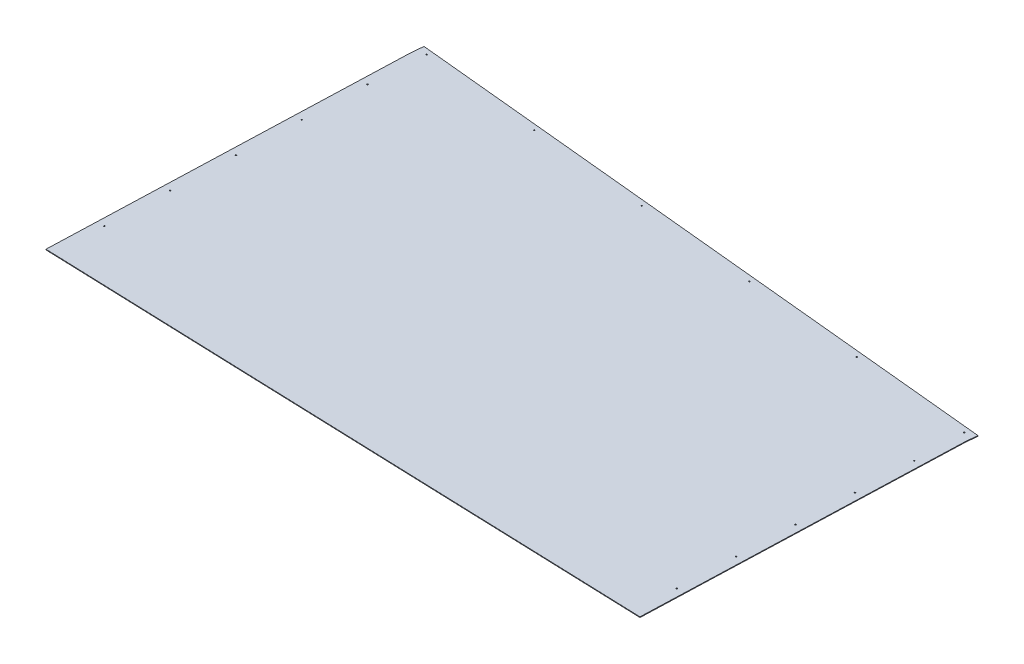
ISO-10303-21;
HEADER;
FILE_DESCRIPTION(('STEP AP214'),'2;1');
FILE_NAME('part.step','',(''),(''),'','','');
FILE_SCHEMA(('AUTOMOTIVE_DESIGN { 1 0 10303 214 1 1 1 1 }'));
ENDSEC;
DATA;
#1=APPLICATION_CONTEXT('core data for automotive mechanical design processes');
#2=APPLICATION_PROTOCOL_DEFINITION('international standard','automotive_design',2000,#1);
#3=PRODUCT_CONTEXT('',#1,'mechanical');
#4=PRODUCT('Part','Part','',(#3));
#5=PRODUCT_RELATED_PRODUCT_CATEGORY('part','',(#4));
#6=PRODUCT_DEFINITION_FORMATION('','',#4);
#7=PRODUCT_DEFINITION_CONTEXT('part definition',#1,'design');
#8=PRODUCT_DEFINITION('design','',#6,#7);
#9=PRODUCT_DEFINITION_SHAPE('','',#8);
#10=(LENGTH_UNIT() NAMED_UNIT(*) SI_UNIT(.MILLI.,.METRE.));
#11=(NAMED_UNIT(*) PLANE_ANGLE_UNIT() SI_UNIT($,.RADIAN.));
#12=(NAMED_UNIT(*) SI_UNIT($,.STERADIAN.) SOLID_ANGLE_UNIT());
#13=UNCERTAINTY_MEASURE_WITH_UNIT(LENGTH_MEASURE(1.E-05),#10,'distance_accuracy_value','');
#14=(GEOMETRIC_REPRESENTATION_CONTEXT(3) GLOBAL_UNCERTAINTY_ASSIGNED_CONTEXT((#13)) GLOBAL_UNIT_ASSIGNED_CONTEXT((#10,
#11,#12)) REPRESENTATION_CONTEXT('',''));
#15=CARTESIAN_POINT('',(0.,0.,0.));
#16=DIRECTION('',(0.,0.,1.));
#17=DIRECTION('',(1.,0.,0.));
#18=AXIS2_PLACEMENT_3D('',#15,#16,#17);
#19=CARTESIAN_POINT('',(-728.973178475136,-2.53999999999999,-1428.44640067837));
#20=DIRECTION('',(0.,1.,0.));
#21=DIRECTION('',(-0.995256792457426,0.,-0.0972826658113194));
#22=AXIS2_PLACEMENT_3D('',#19,#20,#21);
#23=CYLINDRICAL_SURFACE('',#22,1.58750000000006);
#24=CARTESIAN_POINT('',(-728.973178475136,0.,-1428.44640067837));
#25=DIRECTION('',(0.,1.,0.));
#26=DIRECTION('',(-0.995256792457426,0.,-0.0972826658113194));
#27=AXIS2_PLACEMENT_3D('',#24,#25,#26);
#28=CIRCLE('',#27,1.58750000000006);
#29=CARTESIAN_POINT('',(-730.553148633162,0.,-1428.60083691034));
#30=VERTEX_POINT('',#29);
#31=EDGE_CURVE('E198',#30,#30,#28,.T.);
#32=ORIENTED_EDGE('',*,*,#31,.T.);
#33=EDGE_LOOP('',(#32));
#34=FACE_BOUND('',#33,.T.);
#35=CARTESIAN_POINT('',(-728.973178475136,-1.62560000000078,-1428.44640067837));
#36=DIRECTION('',(0.,1.,0.));
#37=DIRECTION('',(-0.995256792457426,0.,-0.0972826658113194));
#38=AXIS2_PLACEMENT_3D('',#35,#36,#37);
#39=CIRCLE('',#38,1.58750000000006);
#40=CARTESIAN_POINT('',(-730.553148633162,-1.62560000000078,-1428.60083691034));
#41=VERTEX_POINT('',#40);
#42=EDGE_CURVE('E202',#41,#41,#39,.T.);
#43=ORIENTED_EDGE('',*,*,#42,.F.);
#44=EDGE_LOOP('',(#43));
#45=FACE_BOUND('',#44,.T.);
#46=ADVANCED_FACE('F99',(#34,#45),#23,.F.);
#47=CARTESIAN_POINT('',(-425.618908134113,-2.54000000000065,-1398.79464413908));
#48=DIRECTION('',(0.,1.,0.));
#49=DIRECTION('',(-0.995256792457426,0.,-0.0972826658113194));
#50=AXIS2_PLACEMENT_3D('',#47,#48,#49);
#51=CYLINDRICAL_SURFACE('',#50,1.58749999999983);
#52=CARTESIAN_POINT('',(-425.618908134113,-6.66133814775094E-13,-1398.79464413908));
#53=DIRECTION('',(0.,1.,0.));
#54=DIRECTION('',(-0.995256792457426,0.,-0.0972826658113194));
#55=AXIS2_PLACEMENT_3D('',#52,#53,#54);
#56=CIRCLE('',#55,1.58749999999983);
#57=CARTESIAN_POINT('',(-427.198878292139,-6.64261180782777E-13,-1398.94908037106));
#58=VERTEX_POINT('',#57);
#59=EDGE_CURVE('E241',#58,#58,#56,.T.);
#60=ORIENTED_EDGE('',*,*,#59,.T.);
#61=EDGE_LOOP('',(#60));
#62=FACE_BOUND('',#61,.T.);
#63=CARTESIAN_POINT('',(-425.618908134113,-1.62560000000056,-1398.79464413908));
#64=DIRECTION('',(0.,1.,0.));
#65=DIRECTION('',(-0.995256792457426,0.,-0.0972826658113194));
#66=AXIS2_PLACEMENT_3D('',#63,#64,#65);
#67=CIRCLE('',#66,1.58749999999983);
#68=CARTESIAN_POINT('',(-427.198878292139,-1.62560000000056,-1398.94908037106));
#69=VERTEX_POINT('',#68);
#70=EDGE_CURVE('E205',#69,#69,#67,.T.);
#71=ORIENTED_EDGE('',*,*,#70,.F.);
#72=EDGE_LOOP('',(#71));
#73=FACE_BOUND('',#72,.T.);
#74=ADVANCED_FACE('F273',(#62,#73),#51,.F.);
#75=CARTESIAN_POINT('',(-122.264637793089,-2.54000000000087,-1369.14288759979));
#76=DIRECTION('',(0.,1.,0.));
#77=DIRECTION('',(-0.995256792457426,0.,-0.0972826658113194));
#78=AXIS2_PLACEMENT_3D('',#75,#76,#77);
#79=CYLINDRICAL_SURFACE('',#78,1.58750000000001);
#80=CARTESIAN_POINT('',(-122.264637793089,-8.88178419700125E-13,-1369.14288759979));
#81=DIRECTION('',(0.,1.,0.));
#82=DIRECTION('',(-0.995256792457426,0.,-0.0972826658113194));
#83=AXIS2_PLACEMENT_3D('',#80,#81,#82);
#84=CIRCLE('',#83,1.58750000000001);
#85=CARTESIAN_POINT('',(-123.844607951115,-8.86305785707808E-13,-1369.29732383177));
#86=VERTEX_POINT('',#85);
#87=EDGE_CURVE('E238',#86,#86,#84,.T.);
#88=ORIENTED_EDGE('',*,*,#87,.T.);
#89=EDGE_LOOP('',(#88));
#90=FACE_BOUND('',#89,.T.);
#91=CARTESIAN_POINT('',(-122.264637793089,-1.62560000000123,-1369.14288759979));
#92=DIRECTION('',(0.,1.,0.));
#93=DIRECTION('',(-0.995256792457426,0.,-0.0972826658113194));
#94=AXIS2_PLACEMENT_3D('',#91,#92,#93);
#95=CIRCLE('',#94,1.58750000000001);
#96=CARTESIAN_POINT('',(-123.844607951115,-1.62560000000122,-1369.29732383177));
#97=VERTEX_POINT('',#96);
#98=EDGE_CURVE('E208',#97,#97,#95,.T.);
#99=ORIENTED_EDGE('',*,*,#98,.F.);
#100=EDGE_LOOP('',(#99));
#101=FACE_BOUND('',#100,.T.);
#102=ADVANCED_FACE('F279',(#90,#101),#79,.F.);
#103=CARTESIAN_POINT('',(181.089632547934,-2.54000000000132,-1339.4911310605));
#104=DIRECTION('',(0.,1.,0.));
#105=DIRECTION('',(-0.995256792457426,0.,-0.0972826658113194));
#106=AXIS2_PLACEMENT_3D('',#103,#104,#105);
#107=CYLINDRICAL_SURFACE('',#106,1.58750000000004);
#108=CARTESIAN_POINT('',(181.089632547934,-1.33226762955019E-12,-1339.4911310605));
#109=DIRECTION('',(0.,1.,0.));
#110=DIRECTION('',(-0.995256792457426,0.,-0.0972826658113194));
#111=AXIS2_PLACEMENT_3D('',#108,#109,#110);
#112=CIRCLE('',#111,1.58750000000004);
#113=CARTESIAN_POINT('',(179.509662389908,-1.33039499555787E-12,-1339.64556729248));
#114=VERTEX_POINT('',#113);
#115=EDGE_CURVE('E235',#114,#114,#112,.T.);
#116=ORIENTED_EDGE('',*,*,#115,.T.);
#117=EDGE_LOOP('',(#116));
#118=FACE_BOUND('',#117,.T.);
#119=CARTESIAN_POINT('',(181.089632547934,-1.62560000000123,-1339.4911310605));
#120=DIRECTION('',(0.,1.,0.));
#121=DIRECTION('',(-0.995256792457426,0.,-0.0972826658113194));
#122=AXIS2_PLACEMENT_3D('',#119,#120,#121);
#123=CIRCLE('',#122,1.58750000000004);
#124=CARTESIAN_POINT('',(179.509662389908,-1.62560000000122,-1339.64556729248));
#125=VERTEX_POINT('',#124);
#126=EDGE_CURVE('E211',#125,#125,#123,.T.);
#127=ORIENTED_EDGE('',*,*,#126,.F.);
#128=EDGE_LOOP('',(#127));
#129=FACE_BOUND('',#128,.T.);
#130=ADVANCED_FACE('F288',(#118,#129),#107,.F.);
#131=CARTESIAN_POINT('',(484.443902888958,-2.54000000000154,-1309.83937452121));
#132=DIRECTION('',(0.,1.,0.));
#133=DIRECTION('',(-0.995256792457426,0.,-0.0972826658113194));
#134=AXIS2_PLACEMENT_3D('',#131,#132,#133);
#135=CYLINDRICAL_SURFACE('',#134,1.58750000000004);
#136=CARTESIAN_POINT('',(484.443902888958,-1.77635683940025E-12,-1309.83937452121));
#137=DIRECTION('',(0.,1.,0.));
#138=DIRECTION('',(-0.995256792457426,0.,-0.0972826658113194));
#139=AXIS2_PLACEMENT_3D('',#136,#137,#138);
#140=CIRCLE('',#139,1.58750000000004);
#141=CARTESIAN_POINT('',(482.863932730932,-1.77448420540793E-12,-1309.99381075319));
#142=VERTEX_POINT('',#141);
#143=EDGE_CURVE('E232',#142,#142,#140,.T.);
#144=ORIENTED_EDGE('',*,*,#143,.T.);
#145=EDGE_LOOP('',(#144));
#146=FACE_BOUND('',#145,.T.);
#147=CARTESIAN_POINT('',(484.443902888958,-1.62560000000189,-1309.83937452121));
#148=DIRECTION('',(0.,1.,0.));
#149=DIRECTION('',(-0.995256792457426,0.,-0.0972826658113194));
#150=AXIS2_PLACEMENT_3D('',#147,#148,#149);
#151=CIRCLE('',#150,1.58750000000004);
#152=CARTESIAN_POINT('',(482.863932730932,-1.62560000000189,-1309.99381075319));
#153=VERTEX_POINT('',#152);
#154=EDGE_CURVE('E214',#153,#153,#151,.T.);
#155=ORIENTED_EDGE('',*,*,#154,.F.);
#156=EDGE_LOOP('',(#155));
#157=FACE_BOUND('',#156,.T.);
#158=ADVANCED_FACE('F292',(#146,#157),#135,.F.);
#159=CARTESIAN_POINT('',(787.798173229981,-2.54000000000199,-1280.18761798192));
#160=DIRECTION('',(0.,1.,0.));
#161=DIRECTION('',(-0.995256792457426,0.,-0.0972826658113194));
#162=AXIS2_PLACEMENT_3D('',#159,#160,#161);
#163=CYLINDRICAL_SURFACE('',#162,1.58749999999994);
#164=CARTESIAN_POINT('',(787.798173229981,-1.99840144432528E-12,-1280.18761798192));
#165=DIRECTION('',(0.,1.,0.));
#166=DIRECTION('',(-0.995256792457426,0.,-0.0972826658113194));
#167=AXIS2_PLACEMENT_3D('',#164,#165,#166);
#168=CIRCLE('',#167,1.58749999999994);
#169=CARTESIAN_POINT('',(786.218203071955,-1.99652881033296E-12,-1280.3420542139));
#170=VERTEX_POINT('',#169);
#171=EDGE_CURVE('E229',#170,#170,#168,.T.);
#172=ORIENTED_EDGE('',*,*,#171,.T.);
#173=EDGE_LOOP('',(#172));
#174=FACE_BOUND('',#173,.T.);
#175=CARTESIAN_POINT('',(787.798173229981,-1.62560000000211,-1280.18761798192));
#176=DIRECTION('',(0.,1.,0.));
#177=DIRECTION('',(-0.995256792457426,0.,-0.0972826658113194));
#178=AXIS2_PLACEMENT_3D('',#175,#176,#177);
#179=CIRCLE('',#178,1.58749999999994);
#180=CARTESIAN_POINT('',(786.218203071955,-1.62560000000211,-1280.3420542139));
#181=VERTEX_POINT('',#180);
#182=EDGE_CURVE('E217',#181,#181,#179,.T.);
#183=ORIENTED_EDGE('',*,*,#182,.F.);
#184=EDGE_LOOP('',(#183));
#185=FACE_BOUND('',#184,.T.);
#186=ADVANCED_FACE('F270',(#174,#185),#163,.F.);
#187=CARTESIAN_POINT('',(2192.56312068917,-3152.84793886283,-1155.63757233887));
#188=DIRECTION('',(0.0972826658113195,0.,-0.995256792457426));
#189=DIRECTION('',(-0.995256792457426,0.,-0.0972826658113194));
#190=AXIS2_PLACEMENT_3D('',#187,#188,#189);
#191=PLANE('',#190);
#192=DIRECTION('',(0.,1.,0.));
#193=VECTOR('',#192,1.);
#194=CARTESIAN_POINT('',(-750.455172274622,-3152.84793886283,-1443.30671184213));
#195=LINE('',#194,#193);
#196=CARTESIAN_POINT('',(-750.455172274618,-1.62559999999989,-1443.30671184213));
#197=VERTEX_POINT('',#196);
#198=CARTESIAN_POINT('',(-750.455172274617,0.,-1443.30671184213));
#199=VERTEX_POINT('',#198);
#200=EDGE_CURVE('E227',#197,#199,#195,.T.);
#201=ORIENTED_EDGE('',*,*,#200,.T.);
#202=DIRECTION('',(0.995256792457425,0.,0.0972826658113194));
#203=VECTOR('',#202,1.);
#204=CARTESIAN_POINT('',(2192.56312068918,-3.5527136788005E-12,-1155.63757233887));
#205=LINE('',#204,#203);
#206=CARTESIAN_POINT('',(811.943230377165,-1.77635683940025E-12,-1290.58805388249));
#207=VERTEX_POINT('',#206);
#208=EDGE_CURVE('E225',#199,#207,#205,.T.);
#209=ORIENTED_EDGE('',*,*,#208,.T.);
#210=DIRECTION('',(0.,1.,0.));
#211=VECTOR('',#210,1.);
#212=CARTESIAN_POINT('',(811.943230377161,-3152.84793886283,-1290.58805388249));
#213=LINE('',#212,#211);
#214=CARTESIAN_POINT('',(811.943230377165,-1.62560000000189,-1290.58805388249));
#215=VERTEX_POINT('',#214);
#216=EDGE_CURVE('E221',#215,#207,#213,.T.);
#217=ORIENTED_EDGE('',*,*,#216,.F.);
#218=DIRECTION('',(-0.995256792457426,0.,-0.0972826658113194));
#219=VECTOR('',#218,1.);
#220=CARTESIAN_POINT('',(2192.56312068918,-1.62560000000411,-1155.63757233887));
#221=LINE('',#220,#219);
#222=EDGE_CURVE('E136',#215,#197,#221,.T.);
#223=ORIENTED_EDGE('',*,*,#222,.T.);
#224=EDGE_LOOP('',(#201,#209,#217,#223));
#225=FACE_BOUND('',#224,.T.);
#226=ADVANCED_FACE('F260',(#225),#191,.T.);
#227=CARTESIAN_POINT('',(-753.543896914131,-3152.84793886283,-1411.7073086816));
#228=DIRECTION('',(0.995256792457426,0.,0.0972826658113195));
#229=DIRECTION('',(0.0972826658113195,0.,-0.995256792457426));
#230=AXIS2_PLACEMENT_3D('',#227,#228,#229);
#231=PLANE('',#230);
#232=DIRECTION('',(-0.0972826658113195,0.,0.995256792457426));
#233=VECTOR('',#232,1.);
#234=CARTESIAN_POINT('',(-753.543896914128,0.,-1411.7073086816));
#235=LINE('',#234,#233);
#236=CARTESIAN_POINT('',(-753.44208377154,-1.16226472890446E-13,-1412.7489148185));
#237=VERTEX_POINT('',#236);
#238=EDGE_CURVE('E150',#199,#237,#235,.T.);
#239=ORIENTED_EDGE('',*,*,#238,.F.);
#240=ORIENTED_EDGE('',*,*,#200,.F.);
#241=DIRECTION('',(0.0972826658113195,0.,-0.995256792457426));
#242=VECTOR('',#241,1.);
#243=CARTESIAN_POINT('',(-753.543896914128,-1.62560000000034,-1411.7073086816));
#244=LINE('',#243,#242);
#245=CARTESIAN_POINT('',(-753.44208377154,-1.62560000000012,-1412.7489148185));
#246=VERTEX_POINT('',#245);
#247=EDGE_CURVE('E13',#246,#197,#244,.T.);
#248=ORIENTED_EDGE('',*,*,#247,.F.);
#249=DIRECTION('',(0.,-1.,0.));
#250=VECTOR('',#249,1.);
#251=CARTESIAN_POINT('',(-753.44208377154,-0.812800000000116,-1412.7489148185));
#252=LINE('',#251,#250);
#253=EDGE_CURVE('E174',#237,#246,#252,.T.);
#254=ORIENTED_EDGE('',*,*,#253,.F.);
#255=EDGE_LOOP('',(#239,#240,#248,#254));
#256=FACE_BOUND('',#255,.T.);
#257=ADVANCED_FACE('F262',(#256),#231,.F.);
#258=CARTESIAN_POINT('',(129.551766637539,-1.55431223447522E-12,-1325.38797786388));
#259=DIRECTION('',(0.,1.,0.));
#260=DIRECTION('',(-0.995256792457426,0.,-0.0972826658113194));
#261=AXIS2_PLACEMENT_3D('',#258,#259,#260);
#262=PLANE('',#261);
#263=ORIENTED_EDGE('',*,*,#238,.T.);
#264=DIRECTION('',(0.034738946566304,0.,-0.999396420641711));
#265=VECTOR('',#264,1.);
#266=CARTESIAN_POINT('',(-753.498666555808,-1.1666015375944E-13,-1411.12109827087));
#267=LINE('',#266,#265);
#268=CARTESIAN_POINT('',(-784.630637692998,0.,-515.492888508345));
#269=VERTEX_POINT('',#268);
#270=EDGE_CURVE('E184',#269,#237,#267,.T.);
#271=ORIENTED_EDGE('',*,*,#270,.F.);
#272=DIRECTION('',(0.999396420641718,0.,0.0347389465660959));
#273=VECTOR('',#272,1.);
#274=CARTESIAN_POINT('',(2571.71966629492,0.,-398.82639715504));
#275=LINE('',#274,#273);
#276=CARTESIAN_POINT('',(781.286136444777,0.,-461.06173584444));
#277=VERTEX_POINT('',#276);
#278=EDGE_CURVE('E183',#269,#277,#275,.T.);
#279=ORIENTED_EDGE('',*,*,#278,.T.);
#280=DIRECTION('',(-0.0347389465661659,0.,0.999396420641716));
#281=VECTOR('',#280,1.);
#282=CARTESIAN_POINT('',(809.114461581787,-1.08853898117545E-13,-1261.64814630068));
#283=LINE('',#282,#281);
#284=CARTESIAN_POINT('',(809.114461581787,-1.0842021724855E-13,-1261.64814630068));
#285=VERTEX_POINT('',#284);
#286=EDGE_CURVE('E158',#285,#277,#283,.T.);
#287=ORIENTED_EDGE('',*,*,#286,.F.);
#288=DIRECTION('',(-0.0972826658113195,0.,0.995256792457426));
#289=VECTOR('',#288,1.);
#290=CARTESIAN_POINT('',(808.854505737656,-1.77635683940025E-12,-1258.98865072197));
#291=LINE('',#290,#289);
#292=EDGE_CURVE('E129',#207,#285,#291,.T.);
#293=ORIENTED_EDGE('',*,*,#292,.F.);
#294=ORIENTED_EDGE('',*,*,#208,.F.);
#295=EDGE_LOOP('',(#263,#271,#279,#287,#293,#294));
#296=FACE_BOUND('',#295,.T.);
#297=ORIENTED_EDGE('',*,*,#171,.F.);
#298=EDGE_LOOP('',(#297));
#299=FACE_BOUND('',#298,.T.);
#300=ORIENTED_EDGE('',*,*,#143,.F.);
#301=EDGE_LOOP('',(#300));
#302=FACE_BOUND('',#301,.T.);
#303=ORIENTED_EDGE('',*,*,#115,.F.);
#304=EDGE_LOOP('',(#303));
#305=FACE_BOUND('',#304,.T.);
#306=ORIENTED_EDGE('',*,*,#87,.F.);
#307=EDGE_LOOP('',(#306));
#308=FACE_BOUND('',#307,.T.);
#309=ORIENTED_EDGE('',*,*,#59,.F.);
#310=EDGE_LOOP('',(#309));
#311=FACE_BOUND('',#310,.T.);
#312=ORIENTED_EDGE('',*,*,#31,.F.);
#313=EDGE_LOOP('',(#312));
#314=FACE_BOUND('',#313,.T.);
#315=CARTESIAN_POINT('',(-761.21977537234,0.,-640.618502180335));
#316=DIRECTION('',(0.,1.,0.));
#317=DIRECTION('',(-1.,0.,0.));
#318=AXIS2_PLACEMENT_3D('',#315,#316,#317);
#319=CIRCLE('',#318,1.58750000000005);
#320=CARTESIAN_POINT('',(-762.80727537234,0.,-640.618502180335));
#321=VERTEX_POINT('',#320);
#322=EDGE_CURVE('E623',#321,#321,#319,.F.);
#323=ORIENTED_EDGE('',*,*,#322,.T.);
#324=EDGE_LOOP('',(#323));
#325=FACE_BOUND('',#324,.T.);
#326=CARTESIAN_POINT('',(-755.594671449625,0.,-802.445767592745));
#327=DIRECTION('',(0.,1.,0.));
#328=DIRECTION('',(-1.,0.,0.));
#329=AXIS2_PLACEMENT_3D('',#326,#327,#328);
#330=CIRCLE('',#329,1.58750000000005);
#331=CARTESIAN_POINT('',(-757.182171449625,0.,-802.445767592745));
#332=VERTEX_POINT('',#331);
#333=EDGE_CURVE('E620',#332,#332,#330,.F.);
#334=ORIENTED_EDGE('',*,*,#333,.T.);
#335=EDGE_LOOP('',(#334));
#336=FACE_BOUND('',#335,.T.);
#337=CARTESIAN_POINT('',(-749.969567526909,0.,-964.273033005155));
#338=DIRECTION('',(0.,1.,0.));
#339=DIRECTION('',(-1.,0.,0.));
#340=AXIS2_PLACEMENT_3D('',#337,#338,#339);
#341=CIRCLE('',#340,1.58750000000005);
#342=CARTESIAN_POINT('',(-751.55706752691,0.,-964.273033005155));
#343=VERTEX_POINT('',#342);
#344=EDGE_CURVE('E617',#343,#343,#341,.F.);
#345=ORIENTED_EDGE('',*,*,#344,.T.);
#346=EDGE_LOOP('',(#345));
#347=FACE_BOUND('',#346,.T.);
#348=CARTESIAN_POINT('',(-744.344463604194,0.,-1126.10029841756));
#349=DIRECTION('',(0.,1.,0.));
#350=DIRECTION('',(-1.,0.,0.));
#351=AXIS2_PLACEMENT_3D('',#348,#349,#350);
#352=CIRCLE('',#351,1.58749999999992);
#353=CARTESIAN_POINT('',(-745.931963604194,0.,-1126.10029841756));
#354=VERTEX_POINT('',#353);
#355=EDGE_CURVE('E614',#354,#354,#352,.F.);
#356=ORIENTED_EDGE('',*,*,#355,.T.);
#357=EDGE_LOOP('',(#356));
#358=FACE_BOUND('',#357,.T.);
#359=CARTESIAN_POINT('',(-738.719359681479,0.,-1287.92756382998));
#360=DIRECTION('',(0.,1.,0.));
#361=DIRECTION('',(-1.,0.,0.));
#362=AXIS2_PLACEMENT_3D('',#359,#360,#361);
#363=CIRCLE('',#362,1.58750000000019);
#364=CARTESIAN_POINT('',(-740.306859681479,0.,-1287.92756382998));
#365=VERTEX_POINT('',#364);
#366=EDGE_CURVE('E611',#365,#365,#363,.F.);
#367=ORIENTED_EDGE('',*,*,#366,.T.);
#368=EDGE_LOOP('',(#367));
#369=FACE_BOUND('',#368,.T.);
#370=CARTESIAN_POINT('',(786.309043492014,0.,-1153.94041247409));
#371=DIRECTION('',(0.,1.,0.));
#372=DIRECTION('',(-1.,0.,0.));
#373=AXIS2_PLACEMENT_3D('',#370,#371,#372);
#374=CIRCLE('',#373,1.58749999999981);
#375=CARTESIAN_POINT('',(784.721543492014,0.,-1153.94041247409));
#376=VERTEX_POINT('',#375);
#377=EDGE_CURVE('E608',#376,#376,#374,.F.);
#378=ORIENTED_EDGE('',*,*,#377,.T.);
#379=EDGE_LOOP('',(#378));
#380=FACE_BOUND('',#379,.T.);
#381=CARTESIAN_POINT('',(781.235420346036,0.,-1007.97856523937));
#382=DIRECTION('',(0.,1.,0.));
#383=DIRECTION('',(-1.,0.,0.));
#384=AXIS2_PLACEMENT_3D('',#381,#382,#383);
#385=CIRCLE('',#384,1.58749999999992);
#386=CARTESIAN_POINT('',(779.647920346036,0.,-1007.97856523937));
#387=VERTEX_POINT('',#386);
#388=EDGE_CURVE('E605',#387,#387,#385,.F.);
#389=ORIENTED_EDGE('',*,*,#388,.T.);
#390=EDGE_LOOP('',(#389));
#391=FACE_BOUND('',#390,.T.);
#392=CARTESIAN_POINT('',(776.161797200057,0.,-862.016718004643));
#393=DIRECTION('',(0.,1.,0.));
#394=DIRECTION('',(-1.,0.,0.));
#395=AXIS2_PLACEMENT_3D('',#392,#393,#394);
#396=CIRCLE('',#395,1.58749999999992);
#397=CARTESIAN_POINT('',(774.574297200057,0.,-862.016718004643));
#398=VERTEX_POINT('',#397);
#399=EDGE_CURVE('E600',#398,#398,#396,.F.);
#400=ORIENTED_EDGE('',*,*,#399,.T.);
#401=EDGE_LOOP('',(#400));
#402=FACE_BOUND('',#401,.T.);
#403=CARTESIAN_POINT('',(771.088174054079,0.,-716.054870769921));
#404=DIRECTION('',(0.,1.,0.));
#405=DIRECTION('',(-1.,0.,0.));
#406=AXIS2_PLACEMENT_3D('',#403,#404,#405);
#407=CIRCLE('',#406,1.58749999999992);
#408=CARTESIAN_POINT('',(769.500674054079,0.,-716.054870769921));
#409=VERTEX_POINT('',#408);
#410=EDGE_CURVE('E597',#409,#409,#407,.F.);
#411=ORIENTED_EDGE('',*,*,#410,.T.);
#412=EDGE_LOOP('',(#411));
#413=FACE_BOUND('',#412,.T.);
#414=CARTESIAN_POINT('',(766.0145509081,0.,-570.093023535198));
#415=DIRECTION('',(0.,1.,0.));
#416=DIRECTION('',(-1.,0.,0.));
#417=AXIS2_PLACEMENT_3D('',#414,#415,#416);
#418=CIRCLE('',#417,1.5874999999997);
#419=CARTESIAN_POINT('',(764.4270509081,0.,-570.093023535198));
#420=VERTEX_POINT('',#419);
#421=EDGE_CURVE('E256',#420,#420,#418,.F.);
#422=ORIENTED_EDGE('',*,*,#421,.T.);
#423=EDGE_LOOP('',(#422));
#424=FACE_BOUND('',#423,.T.);
#425=ADVANCED_FACE('F254',(#296,#299,#302,#305,#308,#311,#314,#325,#336,#347,#358,#369,#380,
#391,#402,#413,#424),#262,.T.);
#426=CARTESIAN_POINT('',(808.854505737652,-3152.84793886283,-1258.98865072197));
#427=DIRECTION('',(0.995256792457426,0.,0.0972826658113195));
#428=DIRECTION('',(0.0972826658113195,0.,-0.995256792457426));
#429=AXIS2_PLACEMENT_3D('',#426,#427,#428);
#430=PLANE('',#429);
#431=ORIENTED_EDGE('',*,*,#216,.T.);
#432=ORIENTED_EDGE('',*,*,#292,.T.);
#433=DIRECTION('',(0.,-1.,0.));
#434=VECTOR('',#433,1.);
#435=CARTESIAN_POINT('',(809.114461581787,-0.812800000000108,-1261.64814630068));
#436=LINE('',#435,#434);
#437=CARTESIAN_POINT('',(809.114461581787,-1.62560000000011,-1261.64814630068));
#438=VERTEX_POINT('',#437);
#439=EDGE_CURVE('E199',#285,#438,#436,.T.);
#440=ORIENTED_EDGE('',*,*,#439,.T.);
#441=DIRECTION('',(-0.0972826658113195,0.,0.995256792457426));
#442=VECTOR('',#441,1.);
#443=CARTESIAN_POINT('',(808.854505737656,-1.62560000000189,-1258.98865072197));
#444=LINE('',#443,#442);
#445=EDGE_CURVE('E109',#215,#438,#444,.T.);
#446=ORIENTED_EDGE('',*,*,#445,.F.);
#447=EDGE_LOOP('',(#431,#432,#440,#446));
#448=FACE_BOUND('',#447,.T.);
#449=ADVANCED_FACE('F259',(#448),#430,.T.);
#450=CARTESIAN_POINT('',(0.,-1.6256,0.));
#451=DIRECTION('',(0.,1.,0.));
#452=DIRECTION('',(-1.,0.,0.));
#453=AXIS2_PLACEMENT_3D('',#450,#451,#452);
#454=PLANE('',#453);
#455=ORIENTED_EDGE('',*,*,#182,.T.);
#456=EDGE_LOOP('',(#455));
#457=FACE_BOUND('',#456,.T.);
#458=ORIENTED_EDGE('',*,*,#154,.T.);
#459=EDGE_LOOP('',(#458));
#460=FACE_BOUND('',#459,.T.);
#461=ORIENTED_EDGE('',*,*,#126,.T.);
#462=EDGE_LOOP('',(#461));
#463=FACE_BOUND('',#462,.T.);
#464=ORIENTED_EDGE('',*,*,#98,.T.);
#465=EDGE_LOOP('',(#464));
#466=FACE_BOUND('',#465,.T.);
#467=ORIENTED_EDGE('',*,*,#70,.T.);
#468=EDGE_LOOP('',(#467));
#469=FACE_BOUND('',#468,.T.);
#470=ORIENTED_EDGE('',*,*,#42,.T.);
#471=EDGE_LOOP('',(#470));
#472=FACE_BOUND('',#471,.T.);
#473=ORIENTED_EDGE('',*,*,#445,.T.);
#474=DIRECTION('',(-0.0347389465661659,0.,0.999396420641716));
#475=VECTOR('',#474,1.);
#476=CARTESIAN_POINT('',(809.114461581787,-1.62560000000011,-1261.64814630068));
#477=LINE('',#476,#475);
#478=CARTESIAN_POINT('',(781.286136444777,-1.62560000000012,-461.061735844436));
#479=VERTEX_POINT('',#478);
#480=EDGE_CURVE('E176',#438,#479,#477,.T.);
#481=ORIENTED_EDGE('',*,*,#480,.T.);
#482=DIRECTION('',(0.999396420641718,0.,0.0347389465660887));
#483=VECTOR('',#482,1.);
#484=CARTESIAN_POINT('',(-2552.7,-1.62560000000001,-576.950850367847));
#485=LINE('',#484,#483);
#486=CARTESIAN_POINT('',(-784.630637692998,-1.6256,-515.492888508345));
#487=VERTEX_POINT('',#486);
#488=EDGE_CURVE('E182',#487,#479,#485,.T.);
#489=ORIENTED_EDGE('',*,*,#488,.F.);
#490=DIRECTION('',(0.034738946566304,0.,-0.999396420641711));
#491=VECTOR('',#490,1.);
#492=CARTESIAN_POINT('',(-753.498666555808,-1.62560000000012,-1411.12109827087));
#493=LINE('',#492,#491);
#494=EDGE_CURVE('E169',#487,#246,#493,.T.);
#495=ORIENTED_EDGE('',*,*,#494,.T.);
#496=ORIENTED_EDGE('',*,*,#247,.T.);
#497=ORIENTED_EDGE('',*,*,#222,.F.);
#498=EDGE_LOOP('',(#473,#481,#489,#495,#496,#497));
#499=FACE_BOUND('',#498,.T.);
#500=CARTESIAN_POINT('',(766.0145509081,-1.6256,-570.093023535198));
#501=DIRECTION('',(0.,-1.,0.));
#502=DIRECTION('',(1.,0.,0.));
#503=AXIS2_PLACEMENT_3D('',#500,#501,#502);
#504=CIRCLE('',#503,1.5874999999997);
#505=CARTESIAN_POINT('',(767.6020509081,-1.6256,-570.093023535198));
#506=VERTEX_POINT('',#505);
#507=EDGE_CURVE('E593',#506,#506,#504,.T.);
#508=ORIENTED_EDGE('',*,*,#507,.F.);
#509=EDGE_LOOP('',(#508));
#510=FACE_BOUND('',#509,.T.);
#511=CARTESIAN_POINT('',(771.088174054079,-1.6256,-716.054870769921));
#512=DIRECTION('',(0.,-1.,0.));
#513=DIRECTION('',(1.,0.,0.));
#514=AXIS2_PLACEMENT_3D('',#511,#512,#513);
#515=CIRCLE('',#514,1.58749999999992);
#516=CARTESIAN_POINT('',(772.675674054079,-1.6256,-716.054870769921));
#517=VERTEX_POINT('',#516);
#518=EDGE_CURVE('E627',#517,#517,#515,.T.);
#519=ORIENTED_EDGE('',*,*,#518,.F.);
#520=EDGE_LOOP('',(#519));
#521=FACE_BOUND('',#520,.T.);
#522=CARTESIAN_POINT('',(776.161797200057,-1.6256,-862.016718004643));
#523=DIRECTION('',(0.,-1.,0.));
#524=DIRECTION('',(1.,0.,0.));
#525=AXIS2_PLACEMENT_3D('',#522,#523,#524);
#526=CIRCLE('',#525,1.58749999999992);
#527=CARTESIAN_POINT('',(777.749297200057,-1.6256,-862.016718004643));
#528=VERTEX_POINT('',#527);
#529=EDGE_CURVE('E630',#528,#528,#526,.T.);
#530=ORIENTED_EDGE('',*,*,#529,.F.);
#531=EDGE_LOOP('',(#530));
#532=FACE_BOUND('',#531,.T.);
#533=CARTESIAN_POINT('',(781.235420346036,-1.6256,-1007.97856523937));
#534=DIRECTION('',(0.,-1.,0.));
#535=DIRECTION('',(1.,0.,0.));
#536=AXIS2_PLACEMENT_3D('',#533,#534,#535);
#537=CIRCLE('',#536,1.58749999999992);
#538=CARTESIAN_POINT('',(782.822920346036,-1.6256,-1007.97856523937));
#539=VERTEX_POINT('',#538);
#540=EDGE_CURVE('E633',#539,#539,#537,.T.);
#541=ORIENTED_EDGE('',*,*,#540,.F.);
#542=EDGE_LOOP('',(#541));
#543=FACE_BOUND('',#542,.T.);
#544=CARTESIAN_POINT('',(786.309043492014,-1.6256,-1153.94041247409));
#545=DIRECTION('',(0.,-1.,0.));
#546=DIRECTION('',(1.,0.,0.));
#547=AXIS2_PLACEMENT_3D('',#544,#545,#546);
#548=CIRCLE('',#547,1.58749999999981);
#549=CARTESIAN_POINT('',(787.896543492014,-1.6256,-1153.94041247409));
#550=VERTEX_POINT('',#549);
#551=EDGE_CURVE('E636',#550,#550,#548,.T.);
#552=ORIENTED_EDGE('',*,*,#551,.F.);
#553=EDGE_LOOP('',(#552));
#554=FACE_BOUND('',#553,.T.);
#555=CARTESIAN_POINT('',(-738.719359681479,-1.6256,-1287.92756382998));
#556=DIRECTION('',(0.,-1.,0.));
#557=DIRECTION('',(1.,0.,0.));
#558=AXIS2_PLACEMENT_3D('',#555,#556,#557);
#559=CIRCLE('',#558,1.58750000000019);
#560=CARTESIAN_POINT('',(-737.131859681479,-1.6256,-1287.92756382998));
#561=VERTEX_POINT('',#560);
#562=EDGE_CURVE('E639',#561,#561,#559,.T.);
#563=ORIENTED_EDGE('',*,*,#562,.F.);
#564=EDGE_LOOP('',(#563));
#565=FACE_BOUND('',#564,.T.);
#566=CARTESIAN_POINT('',(-744.344463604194,-1.6256,-1126.10029841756));
#567=DIRECTION('',(0.,-1.,0.));
#568=DIRECTION('',(1.,0.,0.));
#569=AXIS2_PLACEMENT_3D('',#566,#567,#568);
#570=CIRCLE('',#569,1.58749999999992);
#571=CARTESIAN_POINT('',(-742.756963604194,-1.6256,-1126.10029841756));
#572=VERTEX_POINT('',#571);
#573=EDGE_CURVE('E642',#572,#572,#570,.T.);
#574=ORIENTED_EDGE('',*,*,#573,.F.);
#575=EDGE_LOOP('',(#574));
#576=FACE_BOUND('',#575,.T.);
#577=CARTESIAN_POINT('',(-749.969567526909,-1.6256,-964.273033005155));
#578=DIRECTION('',(0.,-1.,0.));
#579=DIRECTION('',(1.,0.,0.));
#580=AXIS2_PLACEMENT_3D('',#577,#578,#579);
#581=CIRCLE('',#580,1.58750000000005);
#582=CARTESIAN_POINT('',(-748.382067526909,-1.6256,-964.273033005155));
#583=VERTEX_POINT('',#582);
#584=EDGE_CURVE('E645',#583,#583,#581,.T.);
#585=ORIENTED_EDGE('',*,*,#584,.F.);
#586=EDGE_LOOP('',(#585));
#587=FACE_BOUND('',#586,.T.);
#588=CARTESIAN_POINT('',(-755.594671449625,-1.6256,-802.445767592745));
#589=DIRECTION('',(0.,-1.,0.));
#590=DIRECTION('',(1.,0.,0.));
#591=AXIS2_PLACEMENT_3D('',#588,#589,#590);
#592=CIRCLE('',#591,1.58750000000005);
#593=CARTESIAN_POINT('',(-754.007171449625,-1.6256,-802.445767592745));
#594=VERTEX_POINT('',#593);
#595=EDGE_CURVE('E192',#594,#594,#592,.T.);
#596=ORIENTED_EDGE('',*,*,#595,.F.);
#597=EDGE_LOOP('',(#596));
#598=FACE_BOUND('',#597,.T.);
#599=CARTESIAN_POINT('',(-761.21977537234,-1.6256,-640.618502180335));
#600=DIRECTION('',(0.,-1.,0.));
#601=DIRECTION('',(1.,0.,0.));
#602=AXIS2_PLACEMENT_3D('',#599,#600,#601);
#603=CIRCLE('',#602,1.58750000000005);
#604=CARTESIAN_POINT('',(-759.63227537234,-1.6256,-640.618502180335));
#605=VERTEX_POINT('',#604);
#606=EDGE_CURVE('E188',#605,#605,#603,.T.);
#607=ORIENTED_EDGE('',*,*,#606,.F.);
#608=EDGE_LOOP('',(#607));
#609=FACE_BOUND('',#608,.T.);
#610=ADVANCED_FACE('F101',(#457,#460,#463,#466,#469,#472,#499,#510,#521,#532,#543,#554,#565,
#576,#587,#598,#609),#454,.F.);
#611=CARTESIAN_POINT('',(-753.498666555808,-0.812800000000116,-1411.12109827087));
#612=DIRECTION('',(-0.999396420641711,0.,-0.034738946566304));
#613=DIRECTION('',(0.034738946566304,0.,-0.999396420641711));
#614=AXIS2_PLACEMENT_3D('',#611,#612,#613);
#615=PLANE('',#614);
#616=ORIENTED_EDGE('',*,*,#494,.F.);
#617=DIRECTION('',(0.,1.,0.));
#618=VECTOR('',#617,1.);
#619=CARTESIAN_POINT('',(-784.630637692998,-3712.29968014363,-515.492888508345));
#620=LINE('',#619,#618);
#621=EDGE_CURVE('E173',#487,#269,#620,.T.);
#622=ORIENTED_EDGE('',*,*,#621,.T.);
#623=ORIENTED_EDGE('',*,*,#270,.T.);
#624=ORIENTED_EDGE('',*,*,#253,.T.);
#625=EDGE_LOOP('',(#616,#622,#623,#624));
#626=FACE_BOUND('',#625,.T.);
#627=ADVANCED_FACE('F171',(#626),#615,.T.);
#628=CARTESIAN_POINT('',(809.114461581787,-0.812800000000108,-1261.64814630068));
#629=DIRECTION('',(0.999396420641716,0.,0.0347389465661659));
#630=DIRECTION('',(-0.0347389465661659,0.,0.999396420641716));
#631=AXIS2_PLACEMENT_3D('',#628,#629,#630);
#632=PLANE('',#631);
#633=ORIENTED_EDGE('',*,*,#286,.T.);
#634=DIRECTION('',(0.,1.,0.));
#635=VECTOR('',#634,1.);
#636=CARTESIAN_POINT('',(781.286136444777,-3712.29968014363,-461.061735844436));
#637=LINE('',#636,#635);
#638=EDGE_CURVE('E189',#479,#277,#637,.T.);
#639=ORIENTED_EDGE('',*,*,#638,.F.);
#640=ORIENTED_EDGE('',*,*,#480,.F.);
#641=ORIENTED_EDGE('',*,*,#439,.F.);
#642=EDGE_LOOP('',(#633,#639,#640,#641));
#643=FACE_BOUND('',#642,.T.);
#644=ADVANCED_FACE('F258',(#643),#632,.T.);
#645=CARTESIAN_POINT('',(-2552.7,-3712.29968014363,-576.950850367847));
#646=DIRECTION('',(-0.0347389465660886,0.,0.999396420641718));
#647=DIRECTION('',(0.999396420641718,0.,0.0347389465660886));
#648=AXIS2_PLACEMENT_3D('',#645,#646,#647);
#649=PLANE('',#648);
#650=ORIENTED_EDGE('',*,*,#638,.T.);
#651=ORIENTED_EDGE('',*,*,#278,.F.);
#652=ORIENTED_EDGE('',*,*,#621,.F.);
#653=ORIENTED_EDGE('',*,*,#488,.T.);
#654=EDGE_LOOP('',(#650,#651,#652,#653));
#655=FACE_BOUND('',#654,.T.);
#656=ADVANCED_FACE('F181',(#655),#649,.T.);
#657=CARTESIAN_POINT('',(-761.21977537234,4.49012806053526,-640.618502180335));
#658=DIRECTION('',(0.,-1.,0.));
#659=DIRECTION('',(1.,0.,0.));
#660=AXIS2_PLACEMENT_3D('',#657,#658,#659);
#661=CYLINDRICAL_SURFACE('',#660,1.58750000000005);
#662=ORIENTED_EDGE('',*,*,#606,.T.);
#663=EDGE_LOOP('',(#662));
#664=FACE_BOUND('',#663,.T.);
#665=ORIENTED_EDGE('',*,*,#322,.F.);
#666=EDGE_LOOP('',(#665));
#667=FACE_BOUND('',#666,.T.);
#668=ADVANCED_FACE('F369',(#664,#667),#661,.F.);
#669=CARTESIAN_POINT('',(-755.594671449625,4.49012806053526,-802.445767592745));
#670=DIRECTION('',(0.,-1.,0.));
#671=DIRECTION('',(1.,0.,0.));
#672=AXIS2_PLACEMENT_3D('',#669,#670,#671);
#673=CYLINDRICAL_SURFACE('',#672,1.58750000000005);
#674=ORIENTED_EDGE('',*,*,#595,.T.);
#675=EDGE_LOOP('',(#674));
#676=FACE_BOUND('',#675,.T.);
#677=ORIENTED_EDGE('',*,*,#333,.F.);
#678=EDGE_LOOP('',(#677));
#679=FACE_BOUND('',#678,.T.);
#680=ADVANCED_FACE('F376',(#676,#679),#673,.F.);
#681=CARTESIAN_POINT('',(-749.969567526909,4.49012806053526,-964.273033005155));
#682=DIRECTION('',(0.,-1.,0.));
#683=DIRECTION('',(1.,0.,0.));
#684=AXIS2_PLACEMENT_3D('',#681,#682,#683);
#685=CYLINDRICAL_SURFACE('',#684,1.58750000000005);
#686=ORIENTED_EDGE('',*,*,#584,.T.);
#687=EDGE_LOOP('',(#686));
#688=FACE_BOUND('',#687,.T.);
#689=ORIENTED_EDGE('',*,*,#344,.F.);
#690=EDGE_LOOP('',(#689));
#691=FACE_BOUND('',#690,.T.);
#692=ADVANCED_FACE('F384',(#688,#691),#685,.F.);
#693=CARTESIAN_POINT('',(-744.344463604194,4.49012806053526,-1126.10029841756));
#694=DIRECTION('',(0.,-1.,0.));
#695=DIRECTION('',(1.,0.,0.));
#696=AXIS2_PLACEMENT_3D('',#693,#694,#695);
#697=CYLINDRICAL_SURFACE('',#696,1.58749999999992);
#698=ORIENTED_EDGE('',*,*,#573,.T.);
#699=EDGE_LOOP('',(#698));
#700=FACE_BOUND('',#699,.T.);
#701=ORIENTED_EDGE('',*,*,#355,.F.);
#702=EDGE_LOOP('',(#701));
#703=FACE_BOUND('',#702,.T.);
#704=ADVANCED_FACE('F392',(#700,#703),#697,.F.);
#705=CARTESIAN_POINT('',(-738.719359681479,4.49012806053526,-1287.92756382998));
#706=DIRECTION('',(0.,-1.,0.));
#707=DIRECTION('',(1.,0.,0.));
#708=AXIS2_PLACEMENT_3D('',#705,#706,#707);
#709=CYLINDRICAL_SURFACE('',#708,1.58750000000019);
#710=ORIENTED_EDGE('',*,*,#562,.T.);
#711=EDGE_LOOP('',(#710));
#712=FACE_BOUND('',#711,.T.);
#713=ORIENTED_EDGE('',*,*,#366,.F.);
#714=EDGE_LOOP('',(#713));
#715=FACE_BOUND('',#714,.T.);
#716=ADVANCED_FACE('F400',(#712,#715),#709,.F.);
#717=CARTESIAN_POINT('',(786.309043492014,4.49012806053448,-1153.94041247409));
#718=DIRECTION('',(0.,-1.,0.));
#719=DIRECTION('',(1.,0.,0.));
#720=AXIS2_PLACEMENT_3D('',#717,#718,#719);
#721=CYLINDRICAL_SURFACE('',#720,1.58749999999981);
#722=ORIENTED_EDGE('',*,*,#551,.T.);
#723=EDGE_LOOP('',(#722));
#724=FACE_BOUND('',#723,.T.);
#725=ORIENTED_EDGE('',*,*,#377,.F.);
#726=EDGE_LOOP('',(#725));
#727=FACE_BOUND('',#726,.T.);
#728=ADVANCED_FACE('F408',(#724,#727),#721,.F.);
#729=CARTESIAN_POINT('',(781.235420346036,4.49012806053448,-1007.97856523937));
#730=DIRECTION('',(0.,-1.,0.));
#731=DIRECTION('',(1.,0.,0.));
#732=AXIS2_PLACEMENT_3D('',#729,#730,#731);
#733=CYLINDRICAL_SURFACE('',#732,1.58749999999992);
#734=ORIENTED_EDGE('',*,*,#540,.T.);
#735=EDGE_LOOP('',(#734));
#736=FACE_BOUND('',#735,.T.);
#737=ORIENTED_EDGE('',*,*,#388,.F.);
#738=EDGE_LOOP('',(#737));
#739=FACE_BOUND('',#738,.T.);
#740=ADVANCED_FACE('F416',(#736,#739),#733,.F.);
#741=CARTESIAN_POINT('',(776.161797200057,4.49012806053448,-862.016718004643));
#742=DIRECTION('',(0.,-1.,0.));
#743=DIRECTION('',(1.,0.,0.));
#744=AXIS2_PLACEMENT_3D('',#741,#742,#743);
#745=CYLINDRICAL_SURFACE('',#744,1.58749999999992);
#746=ORIENTED_EDGE('',*,*,#529,.T.);
#747=EDGE_LOOP('',(#746));
#748=FACE_BOUND('',#747,.T.);
#749=ORIENTED_EDGE('',*,*,#399,.F.);
#750=EDGE_LOOP('',(#749));
#751=FACE_BOUND('',#750,.T.);
#752=ADVANCED_FACE('F424',(#748,#751),#745,.F.);
#753=CARTESIAN_POINT('',(771.088174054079,4.49012806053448,-716.054870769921));
#754=DIRECTION('',(0.,-1.,0.));
#755=DIRECTION('',(1.,0.,0.));
#756=AXIS2_PLACEMENT_3D('',#753,#754,#755);
#757=CYLINDRICAL_SURFACE('',#756,1.58749999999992);
#758=ORIENTED_EDGE('',*,*,#518,.T.);
#759=EDGE_LOOP('',(#758));
#760=FACE_BOUND('',#759,.T.);
#761=ORIENTED_EDGE('',*,*,#410,.F.);
#762=EDGE_LOOP('',(#761));
#763=FACE_BOUND('',#762,.T.);
#764=ADVANCED_FACE('F432',(#760,#763),#757,.F.);
#765=CARTESIAN_POINT('',(766.0145509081,4.49012806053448,-570.093023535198));
#766=DIRECTION('',(0.,-1.,0.));
#767=DIRECTION('',(1.,0.,0.));
#768=AXIS2_PLACEMENT_3D('',#765,#766,#767);
#769=CYLINDRICAL_SURFACE('',#768,1.5874999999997);
#770=ORIENTED_EDGE('',*,*,#507,.T.);
#771=EDGE_LOOP('',(#770));
#772=FACE_BOUND('',#771,.T.);
#773=ORIENTED_EDGE('',*,*,#421,.F.);
#774=EDGE_LOOP('',(#773));
#775=FACE_BOUND('',#774,.T.);
#776=ADVANCED_FACE('F440',(#772,#775),#769,.F.);
#777=CLOSED_SHELL('',(#46,#74,#102,#130,#158,#186,#226,#257,#425,#449,#610,#627,#644,#656,#668,
#680,#692,#704,#716,#728,#740,#752,#764,#776));
#778=MANIFOLD_SOLID_BREP('B2',#777);
#779=ADVANCED_BREP_SHAPE_REPRESENTATION('',(#18,#778),#14);
#780=SHAPE_DEFINITION_REPRESENTATION(#9,#779);
ENDSEC;
END-ISO-10303-21;
